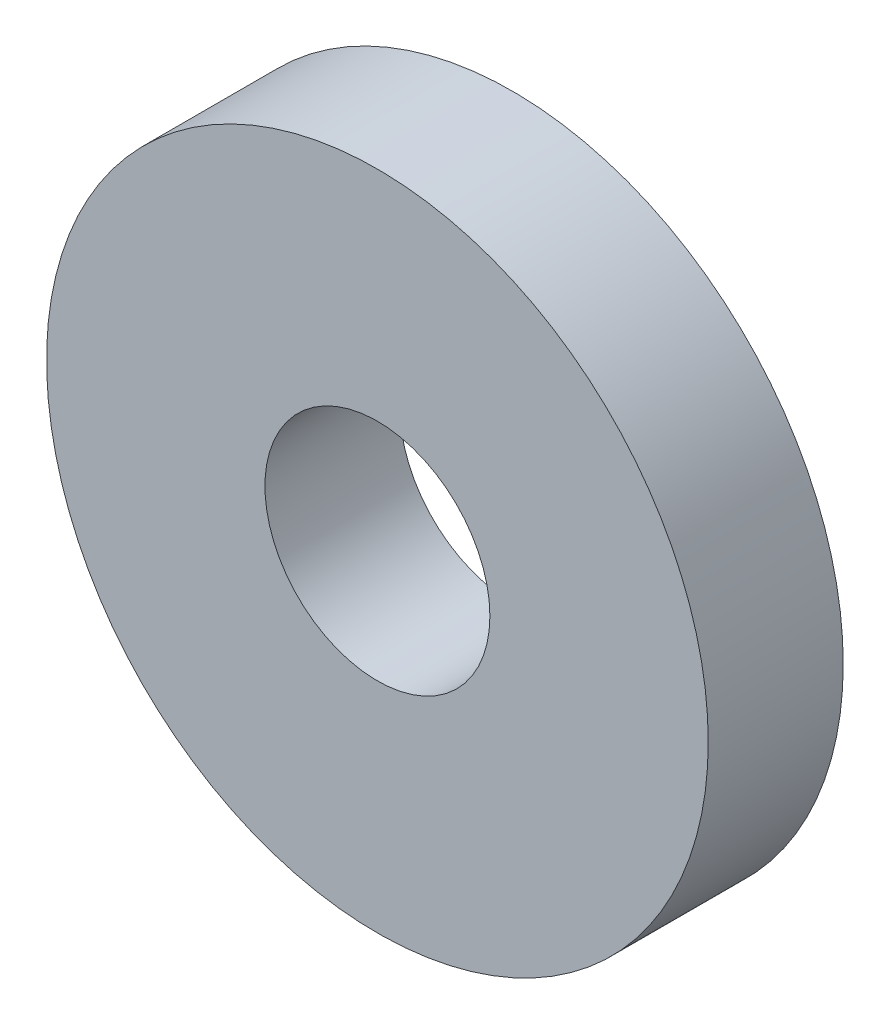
from build123d import *

# Parameters (mm, degrees)
SKETCH1_R        = 12.5
SKETCH1_R_2      = 4.25
EXTRUSION1_DEPTH = 5.1


with BuildPart() as part:
    # Sketch1 → Extrusion1 (new body)
    with BuildSketch(Plane.XY):
        Circle(SKETCH1_R)
        Circle(SKETCH1_R_2, mode=Mode.SUBTRACT)
    extrude(amount=EXTRUSION1_DEPTH)


solid = part.part
